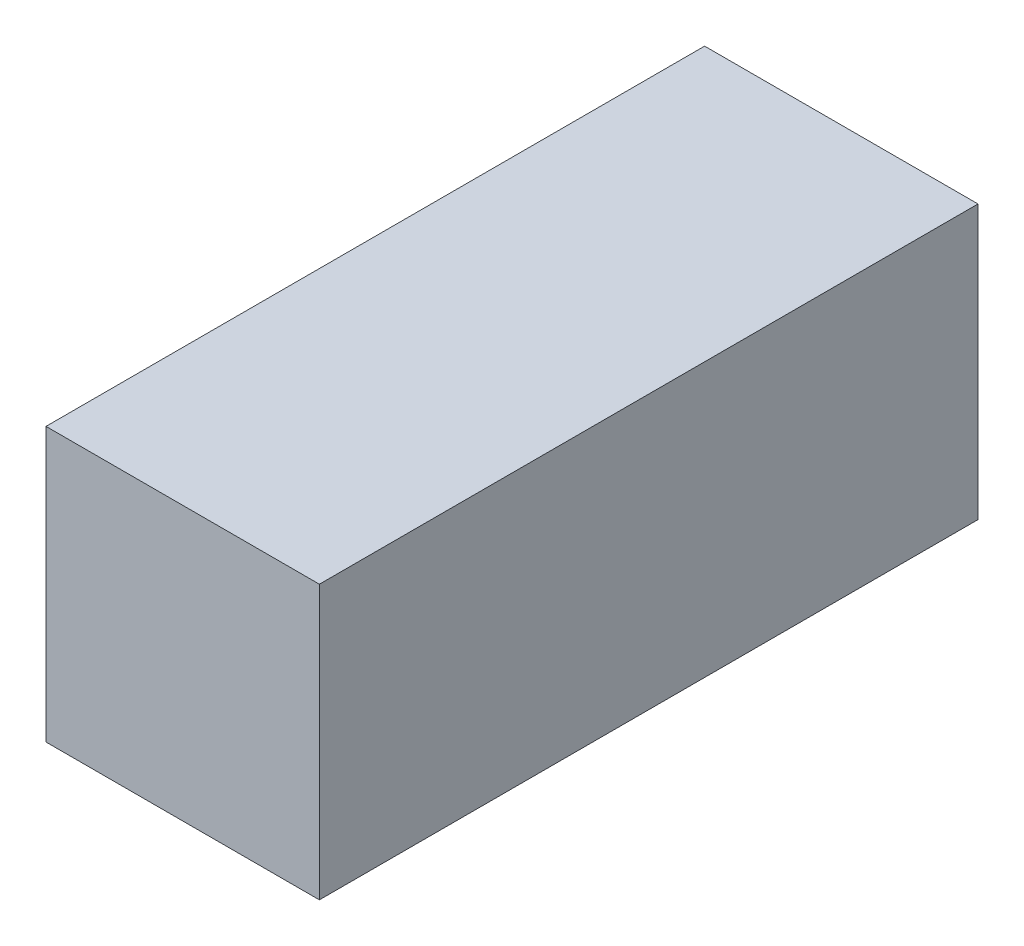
ISO-10303-21;
HEADER;
FILE_DESCRIPTION(('STEP AP214'),'2;1');
FILE_NAME('part.step','',(''),(''),'','','');
FILE_SCHEMA(('AUTOMOTIVE_DESIGN { 1 0 10303 214 1 1 1 1 }'));
ENDSEC;
DATA;
#1=APPLICATION_CONTEXT('core data for automotive mechanical design processes');
#2=APPLICATION_PROTOCOL_DEFINITION('international standard','automotive_design',2000,#1);
#3=PRODUCT_CONTEXT('',#1,'mechanical');
#4=PRODUCT('Part','Part','',(#3));
#5=PRODUCT_RELATED_PRODUCT_CATEGORY('part','',(#4));
#6=PRODUCT_DEFINITION_FORMATION('','',#4);
#7=PRODUCT_DEFINITION_CONTEXT('part definition',#1,'design');
#8=PRODUCT_DEFINITION('design','',#6,#7);
#9=PRODUCT_DEFINITION_SHAPE('','',#8);
#10=(LENGTH_UNIT() NAMED_UNIT(*) SI_UNIT(.MILLI.,.METRE.));
#11=(NAMED_UNIT(*) PLANE_ANGLE_UNIT() SI_UNIT($,.RADIAN.));
#12=(NAMED_UNIT(*) SI_UNIT($,.STERADIAN.) SOLID_ANGLE_UNIT());
#13=UNCERTAINTY_MEASURE_WITH_UNIT(LENGTH_MEASURE(1.E-05),#10,'distance_accuracy_value','');
#14=(GEOMETRIC_REPRESENTATION_CONTEXT(3) GLOBAL_UNCERTAINTY_ASSIGNED_CONTEXT((#13)) GLOBAL_UNIT_ASSIGNED_CONTEXT((#10,
#11,#12)) REPRESENTATION_CONTEXT('',''));
#15=CARTESIAN_POINT('',(0.,0.,0.));
#16=DIRECTION('',(0.,0.,1.));
#17=DIRECTION('',(1.,0.,0.));
#18=AXIS2_PLACEMENT_3D('',#15,#16,#17);
#19=CARTESIAN_POINT('',(0.,0.,132.5));
#20=DIRECTION('',(1.,0.,0.));
#21=DIRECTION('',(0.,0.,-1.));
#22=AXIS2_PLACEMENT_3D('',#19,#20,#21);
#23=PLANE('',#22);
#24=DIRECTION('',(0.,-1.,0.));
#25=VECTOR('',#24,1.);
#26=CARTESIAN_POINT('',(0.,0.,0.));
#27=LINE('',#26,#25);
#28=CARTESIAN_POINT('',(0.,55.,0.));
#29=VERTEX_POINT('',#28);
#30=CARTESIAN_POINT('',(0.,0.,0.));
#31=VERTEX_POINT('',#30);
#32=EDGE_CURVE('E95',#29,#31,#27,.T.);
#33=ORIENTED_EDGE('',*,*,#32,.T.);
#34=DIRECTION('',(0.,0.,-1.));
#35=VECTOR('',#34,1.);
#36=CARTESIAN_POINT('',(0.,0.,132.5));
#37=LINE('',#36,#35);
#38=CARTESIAN_POINT('',(0.,0.,132.5));
#39=VERTEX_POINT('',#38);
#40=EDGE_CURVE('E11',#39,#31,#37,.T.);
#41=ORIENTED_EDGE('',*,*,#40,.F.);
#42=DIRECTION('',(0.,-1.,0.));
#43=VECTOR('',#42,1.);
#44=CARTESIAN_POINT('',(0.,0.,132.5));
#45=LINE('',#44,#43);
#46=CARTESIAN_POINT('',(0.,55.,132.5));
#47=VERTEX_POINT('',#46);
#48=EDGE_CURVE('E83',#47,#39,#45,.T.);
#49=ORIENTED_EDGE('',*,*,#48,.F.);
#50=DIRECTION('',(0.,0.,-1.));
#51=VECTOR('',#50,1.);
#52=CARTESIAN_POINT('',(0.,55.,132.5));
#53=LINE('',#52,#51);
#54=EDGE_CURVE('E91',#47,#29,#53,.T.);
#55=ORIENTED_EDGE('',*,*,#54,.T.);
#56=EDGE_LOOP('',(#33,#41,#49,#55));
#57=FACE_BOUND('',#56,.T.);
#58=ADVANCED_FACE('F32',(#57),#23,.F.);
#59=CARTESIAN_POINT('',(0.,0.,132.5));
#60=DIRECTION('',(0.,1.,0.));
#61=DIRECTION('',(0.,0.,1.));
#62=AXIS2_PLACEMENT_3D('',#59,#60,#61);
#63=PLANE('',#62);
#64=DIRECTION('',(1.,0.,0.));
#65=VECTOR('',#64,1.);
#66=CARTESIAN_POINT('',(0.,0.,0.));
#67=LINE('',#66,#65);
#68=CARTESIAN_POINT('',(55.,0.,0.));
#69=VERTEX_POINT('',#68);
#70=EDGE_CURVE('E87',#31,#69,#67,.T.);
#71=ORIENTED_EDGE('',*,*,#70,.T.);
#72=DIRECTION('',(0.,0.,-1.));
#73=VECTOR('',#72,1.);
#74=CARTESIAN_POINT('',(55.,0.,132.5));
#75=LINE('',#74,#73);
#76=CARTESIAN_POINT('',(55.,0.,132.5));
#77=VERTEX_POINT('',#76);
#78=EDGE_CURVE('E40',#77,#69,#75,.T.);
#79=ORIENTED_EDGE('',*,*,#78,.F.);
#80=DIRECTION('',(1.,0.,0.));
#81=VECTOR('',#80,1.);
#82=CARTESIAN_POINT('',(0.,0.,132.5));
#83=LINE('',#82,#81);
#84=EDGE_CURVE('E78',#39,#77,#83,.T.);
#85=ORIENTED_EDGE('',*,*,#84,.F.);
#86=ORIENTED_EDGE('',*,*,#40,.T.);
#87=EDGE_LOOP('',(#71,#79,#85,#86));
#88=FACE_BOUND('',#87,.T.);
#89=ADVANCED_FACE('F86',(#88),#63,.F.);
#90=CARTESIAN_POINT('',(55.,0.,132.5));
#91=DIRECTION('',(-1.,0.,0.));
#92=DIRECTION('',(0.,0.,1.));
#93=AXIS2_PLACEMENT_3D('',#90,#91,#92);
#94=PLANE('',#93);
#95=DIRECTION('',(0.,1.,0.));
#96=VECTOR('',#95,1.);
#97=CARTESIAN_POINT('',(55.,0.,0.));
#98=LINE('',#97,#96);
#99=CARTESIAN_POINT('',(55.,55.,0.));
#100=VERTEX_POINT('',#99);
#101=EDGE_CURVE('E65',#69,#100,#98,.T.);
#102=ORIENTED_EDGE('',*,*,#101,.T.);
#103=DIRECTION('',(0.,0.,-1.));
#104=VECTOR('',#103,1.);
#105=CARTESIAN_POINT('',(55.,55.,132.5));
#106=LINE('',#105,#104);
#107=CARTESIAN_POINT('',(55.,55.,132.5));
#108=VERTEX_POINT('',#107);
#109=EDGE_CURVE('E88',#108,#100,#106,.T.);
#110=ORIENTED_EDGE('',*,*,#109,.F.);
#111=DIRECTION('',(0.,1.,0.));
#112=VECTOR('',#111,1.);
#113=CARTESIAN_POINT('',(55.,0.,132.5));
#114=LINE('',#113,#112);
#115=EDGE_CURVE('E81',#77,#108,#114,.T.);
#116=ORIENTED_EDGE('',*,*,#115,.F.);
#117=ORIENTED_EDGE('',*,*,#78,.T.);
#118=EDGE_LOOP('',(#102,#110,#116,#117));
#119=FACE_BOUND('',#118,.T.);
#120=ADVANCED_FACE('F89',(#119),#94,.F.);
#121=CARTESIAN_POINT('',(0.,55.,132.5));
#122=DIRECTION('',(0.,-1.,0.));
#123=DIRECTION('',(0.,0.,-1.));
#124=AXIS2_PLACEMENT_3D('',#121,#122,#123);
#125=PLANE('',#124);
#126=DIRECTION('',(-1.,0.,0.));
#127=VECTOR('',#126,1.);
#128=CARTESIAN_POINT('',(0.,55.,0.));
#129=LINE('',#128,#127);
#130=EDGE_CURVE('E71',#100,#29,#129,.T.);
#131=ORIENTED_EDGE('',*,*,#130,.T.);
#132=ORIENTED_EDGE('',*,*,#54,.F.);
#133=DIRECTION('',(-1.,0.,0.));
#134=VECTOR('',#133,1.);
#135=CARTESIAN_POINT('',(0.,55.,132.5));
#136=LINE('',#135,#134);
#137=EDGE_CURVE('E48',#108,#47,#136,.T.);
#138=ORIENTED_EDGE('',*,*,#137,.F.);
#139=ORIENTED_EDGE('',*,*,#109,.T.);
#140=EDGE_LOOP('',(#131,#132,#138,#139));
#141=FACE_BOUND('',#140,.T.);
#142=ADVANCED_FACE('F102',(#141),#125,.F.);
#143=CARTESIAN_POINT('',(0.,55.,132.5));
#144=DIRECTION('',(0.,0.,-1.));
#145=DIRECTION('',(-1.,0.,0.));
#146=AXIS2_PLACEMENT_3D('',#143,#144,#145);
#147=PLANE('',#146);
#148=ORIENTED_EDGE('',*,*,#48,.T.);
#149=ORIENTED_EDGE('',*,*,#84,.T.);
#150=ORIENTED_EDGE('',*,*,#115,.T.);
#151=ORIENTED_EDGE('',*,*,#137,.T.);
#152=EDGE_LOOP('',(#148,#149,#150,#151));
#153=FACE_BOUND('',#152,.T.);
#154=ADVANCED_FACE('F79',(#153),#147,.F.);
#155=CARTESIAN_POINT('',(0.,55.,0.));
#156=DIRECTION('',(0.,0.,-1.));
#157=DIRECTION('',(-1.,0.,0.));
#158=AXIS2_PLACEMENT_3D('',#155,#156,#157);
#159=PLANE('',#158);
#160=ORIENTED_EDGE('',*,*,#32,.F.);
#161=ORIENTED_EDGE('',*,*,#130,.F.);
#162=ORIENTED_EDGE('',*,*,#101,.F.);
#163=ORIENTED_EDGE('',*,*,#70,.F.);
#164=EDGE_LOOP('',(#160,#161,#162,#163));
#165=FACE_BOUND('',#164,.T.);
#166=ADVANCED_FACE('F105',(#165),#159,.T.);
#167=CLOSED_SHELL('',(#58,#89,#120,#142,#154,#166));
#168=MANIFOLD_SOLID_BREP('B2',#167);
#169=ADVANCED_BREP_SHAPE_REPRESENTATION('',(#18,#168),#14);
#170=SHAPE_DEFINITION_REPRESENTATION(#9,#169);
ENDSEC;
END-ISO-10303-21;
